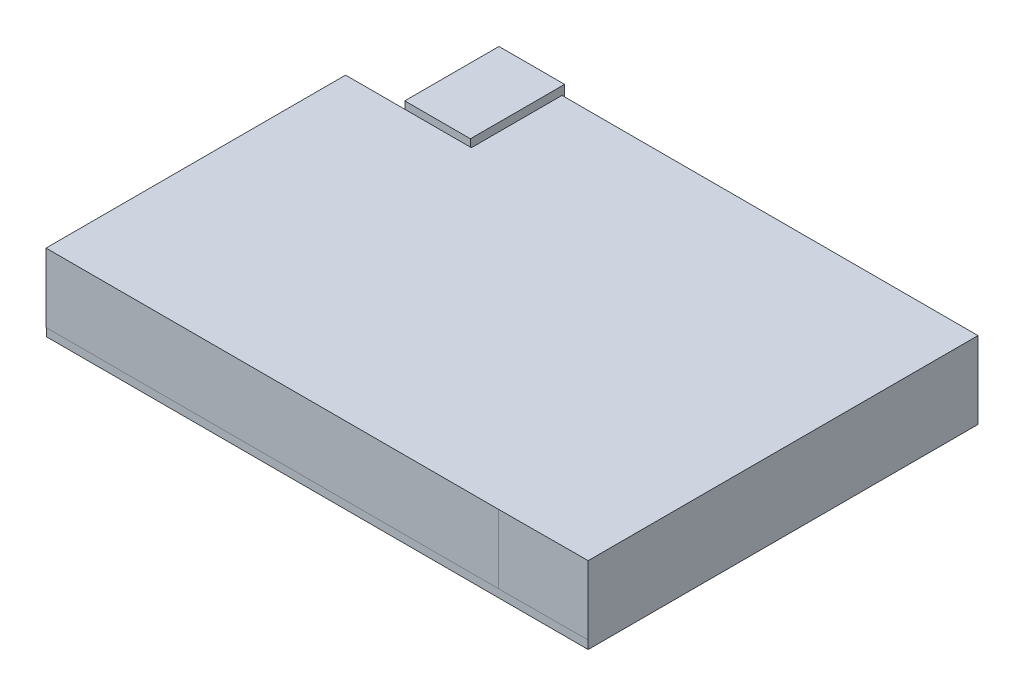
from build123d import *

# Parameters (mm, degrees)
SKETCH1_W             = 100.076
SKETCH1_H             = 72.009
BOSS_EXTRUDE1_DEPTH   = 1.524
F_4_CLEARANCE_HOLE1_D = 3.4544
SKETCH5_W             = 12.127686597
SKETCH5_H             = 17.400593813
BOSS_EXTRUDE2_DEPTH   = 12.7
BOSS_EXTRUDE3_DEPTH   = 12.7


with BuildPart() as part:
    # Sketch1 → Boss-Extrude1 (new body)
    with BuildSketch(Plane(origin=(0, 0, 0), x_dir=(1, 0, 0), z_dir=(0, 1, 0))):
        Rectangle(SKETCH1_W, SKETCH1_H)
    extrude(amount=BOSS_EXTRUDE1_DEPTH)

    # 4 Clearance Hole1 (through all)
    with Locations(Plane(origin=(0, 1.524, 0), x_dir=(1, 0, 0), z_dir=(0, 1, 0))):
        with Locations((-47.0916, 32.9565), (47.0662, 32.9565), (-47.0916, -33.0835), (47.0662, -33.0835)):
            Hole(F_4_CLEARANCE_HOLE1_D / 2)

    # Sketch5 → Boss-Extrude2 (add)
    with BuildSketch(Plane(origin=(0, 1.524, 0), x_dir=(1, 0, 0), z_dir=(0, 1, 0))):
        with Locations((-34.391568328, 29.31142889)):
            Rectangle(SKETCH5_W, SKETCH5_H)
    extrude(amount=BOSS_EXTRUDE2_DEPTH)

    # Sketch6 → Boss-Extrude3 (add)
    with BuildSketch(Plane(origin=(0, 1.524, 0), x_dir=(1, 0, 0), z_dir=(0, 1, 0))):
        Polygon((-50.038, 19.26236069), (-26.801854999, 19.26236069), (-26.801854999, 36.0045), (50.038, 36.0045), (50.038, -36.0045), (33.511568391, -36.075061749), (-50.038, -36.075061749), align=None)
    extrude(amount=BOSS_EXTRUDE3_DEPTH)


solid = part.part
